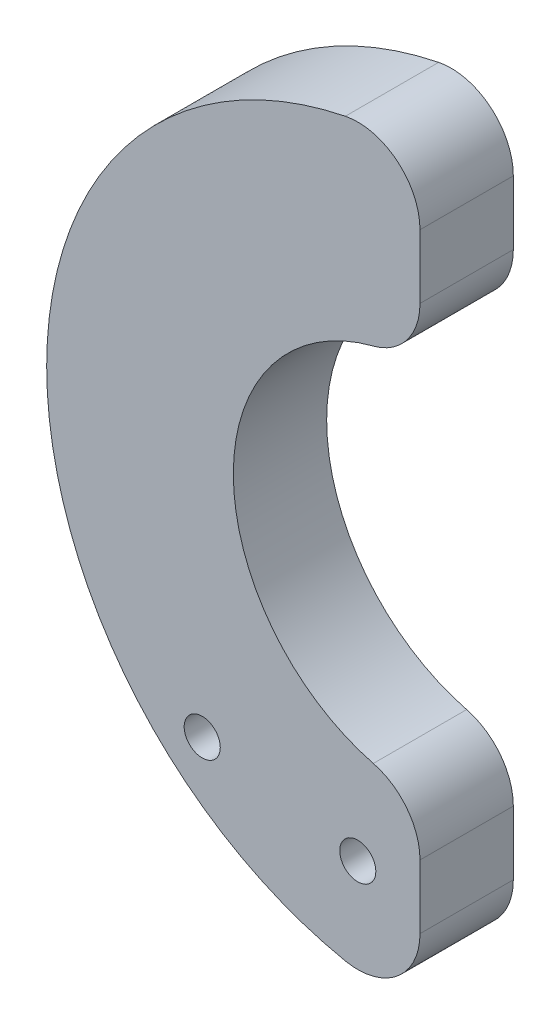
from build123d import *

# Parameters (mm, degrees)
FINGER_BODY_DEPTH      = 4.7625
SKETCH5_R              = 0.92075
FINGER_PIN_HOLES_DEPTH = 28.13612134


with BuildPart() as part:
    # Finger Drawing → Finger Body (new body)
    with BuildSketch(Plane.XY):
        with BuildLine():
            Line((0, 15.554259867), (0, 12.296722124))
            ThreePointArc((0, 12.296722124), (-0.664942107, 10.352439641), (-2.38125, 9.222541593))
            ThreePointArc((-2.38125, 9.222541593), (-9.525, 0), (-2.38125, -9.222541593))
            ThreePointArc((-2.38125, -9.222541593), (-0.664942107, -10.352439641), (0, -12.296722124))
            Line((0, -12.296722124), (0, -15.554259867))
            ThreePointArc((0, -15.554259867), (-1.166953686, -18.013604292), (-3.81, -18.66511184))
            ThreePointArc((-3.81, -18.66511184), (-19.05, 0), (-3.81, 18.66511184))
            ThreePointArc((-3.81, 18.66511184), (-1.166953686, 18.013604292), (0, 15.554259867))
        make_face()
    extrude(amount=FINGER_BODY_DEPTH)

    # Sketch5 → Finger Pin Holes (cut, through all)
    with BuildSketch(Plane.XY.offset(4.7625)):
        with Locations((-3.175, -13.930255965)):
            Circle(SKETCH5_R)
        with Locations((-11.1125, -12.4241527)):
            Circle(SKETCH5_R)
    extrude(amount=-FINGER_PIN_HOLES_DEPTH, mode=Mode.SUBTRACT)


solid = part.part
